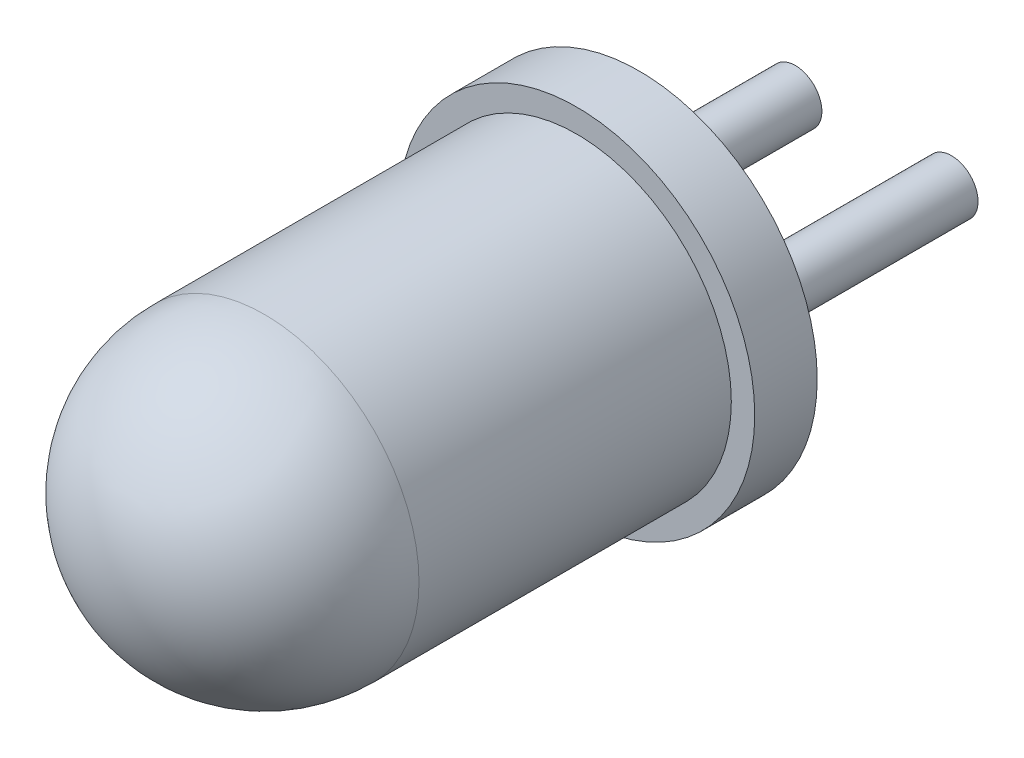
from build123d import *

# Parameters (mm, degrees)
SKETCH_1_R            = 2.8956
EXTRUDE_1_DEPTH       = 1.016
SKETCH_2_R            = 2.5146
EXTRUDE_2_DEPTH       = 5.08
DOME_2_FACE_RADIUS    = 2.5146
DOME_2_HEIGHT         = 2.5146
SKETCH1_R             = 0.4318
BOSS_EXTRUDE1_DEPTH   = 3.81
BOSS_EXTRUDE1_2_DEPTH = 3.81


with BuildPart() as part:
    # Sketch 1 → Extrude 1 (new body)
    with BuildSketch(Plane.XY):
        Circle(SKETCH_1_R)
    extrude(amount=EXTRUDE_1_DEPTH)

    # Sketch 2 → Extrude 2 (add)
    with BuildSketch(Plane.XY.offset(1.016)):
        Circle(SKETCH_2_R)
    extrude(amount=EXTRUDE_2_DEPTH)

    # Dome 2: a dome of height H over a round flat face of radius A is a cap of a sphere of radius (A * A + H * H) / (2 * H)
    dome_2_r = (DOME_2_FACE_RADIUS * DOME_2_FACE_RADIUS + DOME_2_HEIGHT * DOME_2_HEIGHT) / (2 * DOME_2_HEIGHT)
    dome_2_base = Plane((0, 0, 6.096), z_dir=(0, 0, 1))
    with Locations(dome_2_base.offset(DOME_2_HEIGHT - dome_2_r)):
        dome_2_ball = Sphere(dome_2_r, mode=Mode.PRIVATE)
    add(split(dome_2_ball, bisect_by=dome_2_base, keep=Keep.TOP, mode=Mode.PRIVATE))


with BuildPart() as body_2:
    # Sketch1 → Boss-Extrude1 (new body)
    with BuildSketch(Plane(origin=(0, 0, 0), x_dir=(-1, 0, 0), z_dir=(0, 0, -1))):
        with Locations((1.27, 0)):
            Circle(SKETCH1_R)
    extrude(amount=BOSS_EXTRUDE1_DEPTH)


with BuildPart() as body_3:
    # Sketch1 → Boss-Extrude1 2 (new body)
    with BuildSketch(Plane(origin=(0, 0, 0), x_dir=(-1, 0, 0), z_dir=(0, 0, -1))):
        with Locations((-1.27, 0)):
            Circle(SKETCH1_R)
    extrude(amount=BOSS_EXTRUDE1_2_DEPTH)


solid = Compound([part.part, body_2.part, body_3.part])
